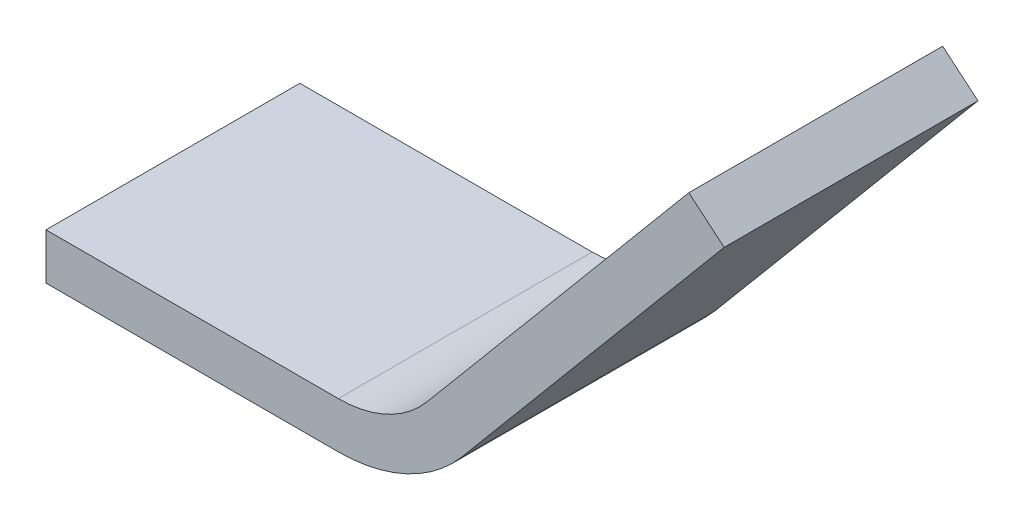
ISO-10303-21;
HEADER;
FILE_DESCRIPTION(('STEP AP214'),'2;1');
FILE_NAME('part.step','',(''),(''),'','','');
FILE_SCHEMA(('AUTOMOTIVE_DESIGN { 1 0 10303 214 1 1 1 1 }'));
ENDSEC;
DATA;
#1=APPLICATION_CONTEXT('core data for automotive mechanical design processes');
#2=APPLICATION_PROTOCOL_DEFINITION('international standard','automotive_design',2000,#1);
#3=PRODUCT_CONTEXT('',#1,'mechanical');
#4=PRODUCT('Part','Part','',(#3));
#5=PRODUCT_RELATED_PRODUCT_CATEGORY('part','',(#4));
#6=PRODUCT_DEFINITION_FORMATION('','',#4);
#7=PRODUCT_DEFINITION_CONTEXT('part definition',#1,'design');
#8=PRODUCT_DEFINITION('design','',#6,#7);
#9=PRODUCT_DEFINITION_SHAPE('','',#8);
#10=(LENGTH_UNIT() NAMED_UNIT(*) SI_UNIT(.MILLI.,.METRE.));
#11=(NAMED_UNIT(*) PLANE_ANGLE_UNIT() SI_UNIT($,.RADIAN.));
#12=(NAMED_UNIT(*) SI_UNIT($,.STERADIAN.) SOLID_ANGLE_UNIT());
#13=UNCERTAINTY_MEASURE_WITH_UNIT(LENGTH_MEASURE(1.E-05),#10,'distance_accuracy_value','');
#14=(GEOMETRIC_REPRESENTATION_CONTEXT(3) GLOBAL_UNCERTAINTY_ASSIGNED_CONTEXT((#13)) GLOBAL_UNIT_ASSIGNED_CONTEXT((#10,
#11,#12)) REPRESENTATION_CONTEXT('',''));
#15=CARTESIAN_POINT('',(0.,0.,0.));
#16=DIRECTION('',(0.,0.,1.));
#17=DIRECTION('',(1.,0.,0.));
#18=AXIS2_PLACEMENT_3D('',#15,#16,#17);
#19=CARTESIAN_POINT('',(0.606154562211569,0.100097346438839,2.2));
#20=DIRECTION('',(-0.766044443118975,0.642787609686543,0.));
#21=DIRECTION('',(-0.642787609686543,-0.766044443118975,0.));
#22=AXIS2_PLACEMENT_3D('',#19,#20,#21);
#23=PLANE('',#22);
#24=DIRECTION('',(0.642787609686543,0.766044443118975,0.));
#25=VECTOR('',#24,1.);
#26=CARTESIAN_POINT('',(0.606154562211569,0.100097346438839,0.));
#27=LINE('',#26,#25);
#28=CARTESIAN_POINT('',(0.606154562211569,0.100097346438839,0.));
#29=VERTEX_POINT('',#28);
#30=CARTESIAN_POINT('',(2.87756821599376,2.80706272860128,0.));
#31=VERTEX_POINT('',#30);
#32=EDGE_CURVE('E130',#29,#31,#27,.T.);
#33=ORIENTED_EDGE('',*,*,#32,.T.);
#34=DIRECTION('',(0.,0.,-1.));
#35=VECTOR('',#34,1.);
#36=CARTESIAN_POINT('',(2.87756821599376,2.80706272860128,2.2));
#37=LINE('',#36,#35);
#38=CARTESIAN_POINT('',(2.87756821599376,2.80706272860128,2.2));
#39=VERTEX_POINT('',#38);
#40=EDGE_CURVE('E11',#39,#31,#37,.T.);
#41=ORIENTED_EDGE('',*,*,#40,.F.);
#42=DIRECTION('',(0.642787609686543,0.766044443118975,0.));
#43=VECTOR('',#42,1.);
#44=CARTESIAN_POINT('',(0.606154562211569,0.100097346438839,2.2));
#45=LINE('',#44,#43);
#46=CARTESIAN_POINT('',(0.606154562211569,0.100097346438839,2.2));
#47=VERTEX_POINT('',#46);
#48=EDGE_CURVE('E88',#47,#39,#45,.T.);
#49=ORIENTED_EDGE('',*,*,#48,.F.);
#50=DIRECTION('',(0.,0.,-1.));
#51=VECTOR('',#50,1.);
#52=CARTESIAN_POINT('',(0.606154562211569,0.100097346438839,2.2));
#53=LINE('',#52,#51);
#54=EDGE_CURVE('E129',#47,#29,#53,.T.);
#55=ORIENTED_EDGE('',*,*,#54,.T.);
#56=EDGE_LOOP('',(#33,#41,#49,#55));
#57=FACE_BOUND('',#56,.T.);
#58=ADVANCED_FACE('F33',(#57),#23,.F.);
#59=CARTESIAN_POINT('',(2.57115043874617,3.0641777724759,2.2));
#60=DIRECTION('',(0.64278760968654,0.766044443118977,0.));
#61=DIRECTION('',(-0.766044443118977,0.642787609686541,0.));
#62=AXIS2_PLACEMENT_3D('',#59,#60,#61);
#63=PLANE('',#62);
#64=DIRECTION('',(0.766044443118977,-0.64278760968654,0.));
#65=VECTOR('',#64,1.);
#66=CARTESIAN_POINT('',(2.57115043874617,3.0641777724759,0.));
#67=LINE('',#66,#65);
#68=CARTESIAN_POINT('',(2.57115043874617,3.0641777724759,0.));
#69=VERTEX_POINT('',#68);
#70=EDGE_CURVE('E133',#69,#31,#67,.T.);
#71=ORIENTED_EDGE('',*,*,#70,.F.);
#72=DIRECTION('',(0.,0.,-1.));
#73=VECTOR('',#72,1.);
#74=CARTESIAN_POINT('',(2.57115043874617,3.0641777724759,2.2));
#75=LINE('',#74,#73);
#76=CARTESIAN_POINT('',(2.57115043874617,3.0641777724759,2.2));
#77=VERTEX_POINT('',#76);
#78=EDGE_CURVE('E41',#77,#69,#75,.T.);
#79=ORIENTED_EDGE('',*,*,#78,.F.);
#80=DIRECTION('',(0.766044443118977,-0.64278760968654,0.));
#81=VECTOR('',#80,1.);
#82=CARTESIAN_POINT('',(2.57115043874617,3.0641777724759,2.2));
#83=LINE('',#82,#81);
#84=EDGE_CURVE('E172',#77,#39,#83,.T.);
#85=ORIENTED_EDGE('',*,*,#84,.T.);
#86=ORIENTED_EDGE('',*,*,#40,.T.);
#87=EDGE_LOOP('',(#71,#79,#85,#86));
#88=FACE_BOUND('',#87,.T.);
#89=ADVANCED_FACE('F163',(#88),#63,.T.);
#90=CARTESIAN_POINT('',(0.299736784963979,0.357212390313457,2.2));
#91=DIRECTION('',(-0.766044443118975,0.642787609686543,0.));
#92=DIRECTION('',(-0.642787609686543,-0.766044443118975,0.));
#93=AXIS2_PLACEMENT_3D('',#90,#91,#92);
#94=PLANE('',#93);
#95=DIRECTION('',(0.642787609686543,0.766044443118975,0.));
#96=VECTOR('',#95,1.);
#97=CARTESIAN_POINT('',(0.299736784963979,0.357212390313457,0.));
#98=LINE('',#97,#96);
#99=CARTESIAN_POINT('',(0.299736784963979,0.357212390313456,0.));
#100=VERTEX_POINT('',#99);
#101=EDGE_CURVE('E136',#100,#69,#98,.T.);
#102=ORIENTED_EDGE('',*,*,#101,.F.);
#103=DIRECTION('',(0.,0.,-1.));
#104=VECTOR('',#103,1.);
#105=CARTESIAN_POINT('',(0.299736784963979,0.357212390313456,2.2));
#106=LINE('',#105,#104);
#107=CARTESIAN_POINT('',(0.299736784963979,0.357212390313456,2.2));
#108=VERTEX_POINT('',#107);
#109=EDGE_CURVE('E153',#108,#100,#106,.T.);
#110=ORIENTED_EDGE('',*,*,#109,.F.);
#111=DIRECTION('',(0.642787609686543,0.766044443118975,0.));
#112=VECTOR('',#111,1.);
#113=CARTESIAN_POINT('',(0.299736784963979,0.357212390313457,2.2));
#114=LINE('',#113,#112);
#115=EDGE_CURVE('E160',#108,#77,#114,.T.);
#116=ORIENTED_EDGE('',*,*,#115,.T.);
#117=ORIENTED_EDGE('',*,*,#78,.T.);
#118=EDGE_LOOP('',(#102,#110,#116,#117));
#119=FACE_BOUND('',#118,.T.);
#120=ADVANCED_FACE('F158',(#119),#94,.T.);
#121=CARTESIAN_POINT('',(-0.466307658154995,1.,2.2));
#122=DIRECTION('',(0.,0.,-1.));
#123=DIRECTION('',(-1.,0.,0.));
#124=AXIS2_PLACEMENT_3D('',#121,#122,#123);
#125=CYLINDRICAL_SURFACE('',#124,1.);
#126=CARTESIAN_POINT('',(-0.466307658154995,1.,0.));
#127=DIRECTION('',(0.,0.,1.));
#128=DIRECTION('',(1.,0.,0.));
#129=AXIS2_PLACEMENT_3D('',#126,#127,#128);
#130=CIRCLE('',#129,1.);
#131=CARTESIAN_POINT('',(-0.466307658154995,0.,0.));
#132=VERTEX_POINT('',#131);
#133=EDGE_CURVE('E139',#132,#100,#130,.T.);
#134=ORIENTED_EDGE('',*,*,#133,.F.);
#135=DIRECTION('',(0.,0.,-1.));
#136=VECTOR('',#135,1.);
#137=CARTESIAN_POINT('',(-0.466307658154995,0.,2.2));
#138=LINE('',#137,#136);
#139=CARTESIAN_POINT('',(-0.466307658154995,0.,2.2));
#140=VERTEX_POINT('',#139);
#141=EDGE_CURVE('E151',#140,#132,#138,.T.);
#142=ORIENTED_EDGE('',*,*,#141,.F.);
#143=CARTESIAN_POINT('',(-0.466307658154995,1.,2.2));
#144=DIRECTION('',(0.,0.,1.));
#145=DIRECTION('',(1.,0.,0.));
#146=AXIS2_PLACEMENT_3D('',#143,#144,#145);
#147=CIRCLE('',#146,1.);
#148=EDGE_CURVE('E124',#140,#108,#147,.T.);
#149=ORIENTED_EDGE('',*,*,#148,.T.);
#150=ORIENTED_EDGE('',*,*,#109,.T.);
#151=EDGE_LOOP('',(#134,#142,#149,#150));
#152=FACE_BOUND('',#151,.T.);
#153=ADVANCED_FACE('F170',(#152),#125,.F.);
#154=CARTESIAN_POINT('',(-0.466307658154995,0.,2.2));
#155=DIRECTION('',(0.,1.,0.));
#156=DIRECTION('',(-1.,0.,0.));
#157=AXIS2_PLACEMENT_3D('',#154,#155,#156);
#158=PLANE('',#157);
#159=DIRECTION('',(1.,0.,0.));
#160=VECTOR('',#159,1.);
#161=CARTESIAN_POINT('',(-0.466307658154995,0.,0.));
#162=LINE('',#161,#160);
#163=CARTESIAN_POINT('',(-3.,0.,0.));
#164=VERTEX_POINT('',#163);
#165=EDGE_CURVE('E142',#164,#132,#162,.T.);
#166=ORIENTED_EDGE('',*,*,#165,.F.);
#167=DIRECTION('',(0.,0.,-1.));
#168=VECTOR('',#167,1.);
#169=CARTESIAN_POINT('',(-3.,0.,2.2));
#170=LINE('',#169,#168);
#171=CARTESIAN_POINT('',(-3.,0.,2.2));
#172=VERTEX_POINT('',#171);
#173=EDGE_CURVE('E112',#172,#164,#170,.T.);
#174=ORIENTED_EDGE('',*,*,#173,.F.);
#175=DIRECTION('',(1.,0.,0.));
#176=VECTOR('',#175,1.);
#177=CARTESIAN_POINT('',(-0.466307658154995,0.,2.2));
#178=LINE('',#177,#176);
#179=EDGE_CURVE('E122',#172,#140,#178,.T.);
#180=ORIENTED_EDGE('',*,*,#179,.T.);
#181=ORIENTED_EDGE('',*,*,#141,.T.);
#182=EDGE_LOOP('',(#166,#174,#180,#181));
#183=FACE_BOUND('',#182,.T.);
#184=ADVANCED_FACE('F177',(#183),#158,.T.);
#185=CARTESIAN_POINT('',(-3.,-0.4,2.2));
#186=DIRECTION('',(-1.,0.,0.));
#187=DIRECTION('',(0.,0.,1.));
#188=AXIS2_PLACEMENT_3D('',#185,#186,#187);
#189=PLANE('',#188);
#190=DIRECTION('',(0.,1.,0.));
#191=VECTOR('',#190,1.);
#192=CARTESIAN_POINT('',(-3.,-0.4,0.));
#193=LINE('',#192,#191);
#194=CARTESIAN_POINT('',(-3.,-0.4,0.));
#195=VERTEX_POINT('',#194);
#196=EDGE_CURVE('E111',#195,#164,#193,.T.);
#197=ORIENTED_EDGE('',*,*,#196,.F.);
#198=DIRECTION('',(0.,0.,-1.));
#199=VECTOR('',#198,1.);
#200=CARTESIAN_POINT('',(-3.,-0.4,2.2));
#201=LINE('',#200,#199);
#202=CARTESIAN_POINT('',(-3.,-0.4,2.2));
#203=VERTEX_POINT('',#202);
#204=EDGE_CURVE('E105',#203,#195,#201,.T.);
#205=ORIENTED_EDGE('',*,*,#204,.F.);
#206=DIRECTION('',(0.,1.,0.));
#207=VECTOR('',#206,1.);
#208=CARTESIAN_POINT('',(-3.,-0.4,2.2));
#209=LINE('',#208,#207);
#210=EDGE_CURVE('E109',#203,#172,#209,.T.);
#211=ORIENTED_EDGE('',*,*,#210,.T.);
#212=ORIENTED_EDGE('',*,*,#173,.T.);
#213=EDGE_LOOP('',(#197,#205,#211,#212));
#214=FACE_BOUND('',#213,.T.);
#215=ADVANCED_FACE('F107',(#214),#189,.T.);
#216=CARTESIAN_POINT('',(-0.466307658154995,-0.4,2.2));
#217=DIRECTION('',(0.,1.,0.));
#218=DIRECTION('',(-1.,0.,0.));
#219=AXIS2_PLACEMENT_3D('',#216,#217,#218);
#220=PLANE('',#219);
#221=DIRECTION('',(1.,0.,0.));
#222=VECTOR('',#221,1.);
#223=CARTESIAN_POINT('',(-0.466307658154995,-0.4,0.));
#224=LINE('',#223,#222);
#225=CARTESIAN_POINT('',(-0.466307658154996,-0.4,0.));
#226=VERTEX_POINT('',#225);
#227=EDGE_CURVE('E76',#195,#226,#224,.T.);
#228=ORIENTED_EDGE('',*,*,#227,.T.);
#229=DIRECTION('',(0.,0.,-1.));
#230=VECTOR('',#229,1.);
#231=CARTESIAN_POINT('',(-0.466307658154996,-0.4,2.2));
#232=LINE('',#231,#230);
#233=CARTESIAN_POINT('',(-0.466307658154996,-0.4,2.2));
#234=VERTEX_POINT('',#233);
#235=EDGE_CURVE('E113',#234,#226,#232,.T.);
#236=ORIENTED_EDGE('',*,*,#235,.F.);
#237=DIRECTION('',(1.,0.,0.));
#238=VECTOR('',#237,1.);
#239=CARTESIAN_POINT('',(-0.466307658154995,-0.4,2.2));
#240=LINE('',#239,#238);
#241=EDGE_CURVE('E115',#203,#234,#240,.T.);
#242=ORIENTED_EDGE('',*,*,#241,.F.);
#243=ORIENTED_EDGE('',*,*,#204,.T.);
#244=EDGE_LOOP('',(#228,#236,#242,#243));
#245=FACE_BOUND('',#244,.T.);
#246=ADVANCED_FACE('F116',(#245),#220,.F.);
#247=CARTESIAN_POINT('',(-0.466307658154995,1.,2.2));
#248=DIRECTION('',(0.,0.,-1.));
#249=DIRECTION('',(-1.,0.,0.));
#250=AXIS2_PLACEMENT_3D('',#247,#248,#249);
#251=CYLINDRICAL_SURFACE('',#250,1.4);
#252=CARTESIAN_POINT('',(-0.466307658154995,1.,0.));
#253=DIRECTION('',(0.,0.,1.));
#254=DIRECTION('',(1.,0.,0.));
#255=AXIS2_PLACEMENT_3D('',#252,#253,#254);
#256=CIRCLE('',#255,1.4);
#257=EDGE_CURVE('E82',#226,#29,#256,.T.);
#258=ORIENTED_EDGE('',*,*,#257,.T.);
#259=ORIENTED_EDGE('',*,*,#54,.F.);
#260=CARTESIAN_POINT('',(-0.466307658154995,1.,2.2));
#261=DIRECTION('',(0.,0.,1.));
#262=DIRECTION('',(1.,0.,0.));
#263=AXIS2_PLACEMENT_3D('',#260,#261,#262);
#264=CIRCLE('',#263,1.4);
#265=EDGE_CURVE('E49',#234,#47,#264,.T.);
#266=ORIENTED_EDGE('',*,*,#265,.F.);
#267=ORIENTED_EDGE('',*,*,#235,.T.);
#268=EDGE_LOOP('',(#258,#259,#266,#267));
#269=FACE_BOUND('',#268,.T.);
#270=ADVANCED_FACE('F179',(#269),#251,.T.);
#271=CARTESIAN_POINT('',(-0.466307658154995,1.,2.2));
#272=DIRECTION('',(0.,0.,1.));
#273=DIRECTION('',(1.,0.,0.));
#274=AXIS2_PLACEMENT_3D('',#271,#272,#273);
#275=PLANE('',#274);
#276=ORIENTED_EDGE('',*,*,#48,.T.);
#277=ORIENTED_EDGE('',*,*,#84,.F.);
#278=ORIENTED_EDGE('',*,*,#115,.F.);
#279=ORIENTED_EDGE('',*,*,#148,.F.);
#280=ORIENTED_EDGE('',*,*,#179,.F.);
#281=ORIENTED_EDGE('',*,*,#210,.F.);
#282=ORIENTED_EDGE('',*,*,#241,.T.);
#283=ORIENTED_EDGE('',*,*,#265,.T.);
#284=EDGE_LOOP('',(#276,#277,#278,#279,#280,#281,#282,#283));
#285=FACE_BOUND('',#284,.T.);
#286=ADVANCED_FACE('F119',(#285),#275,.T.);
#287=CARTESIAN_POINT('',(-0.466307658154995,1.,0.));
#288=DIRECTION('',(0.,0.,1.));
#289=DIRECTION('',(1.,0.,0.));
#290=AXIS2_PLACEMENT_3D('',#287,#288,#289);
#291=PLANE('',#290);
#292=ORIENTED_EDGE('',*,*,#32,.F.);
#293=ORIENTED_EDGE('',*,*,#257,.F.);
#294=ORIENTED_EDGE('',*,*,#227,.F.);
#295=ORIENTED_EDGE('',*,*,#196,.T.);
#296=ORIENTED_EDGE('',*,*,#165,.T.);
#297=ORIENTED_EDGE('',*,*,#133,.T.);
#298=ORIENTED_EDGE('',*,*,#101,.T.);
#299=ORIENTED_EDGE('',*,*,#70,.T.);
#300=EDGE_LOOP('',(#292,#293,#294,#295,#296,#297,#298,#299));
#301=FACE_BOUND('',#300,.T.);
#302=ADVANCED_FACE('F166',(#301),#291,.F.);
#303=CLOSED_SHELL('',(#58,#89,#120,#153,#184,#215,#246,#270,#286,#302));
#304=MANIFOLD_SOLID_BREP('B2',#303);
#305=ADVANCED_BREP_SHAPE_REPRESENTATION('',(#18,#304),#14);
#306=SHAPE_DEFINITION_REPRESENTATION(#9,#305);
ENDSEC;
END-ISO-10303-21;
